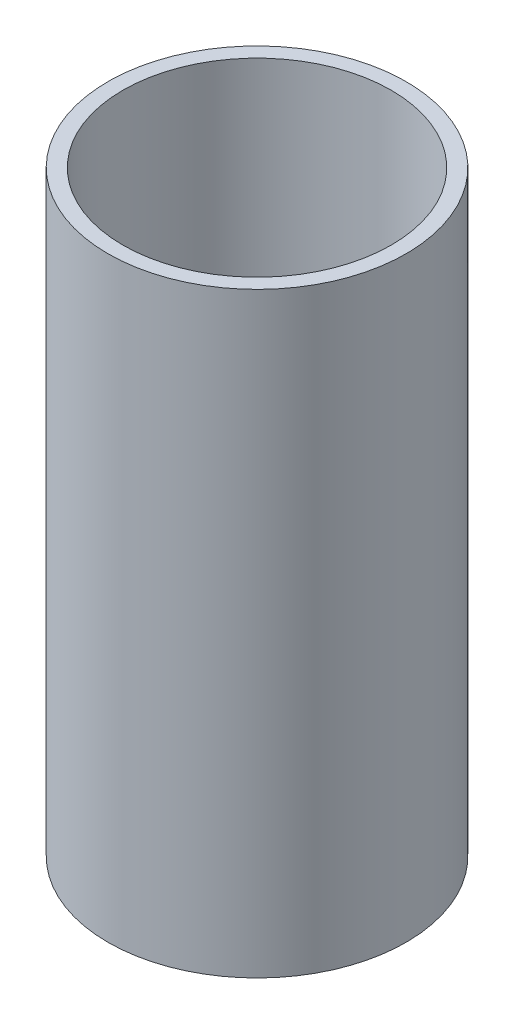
ISO-10303-21;
HEADER;
FILE_DESCRIPTION(('STEP AP214'),'2;1');
FILE_NAME('part.step','',(''),(''),'','','');
FILE_SCHEMA(('AUTOMOTIVE_DESIGN { 1 0 10303 214 1 1 1 1 }'));
ENDSEC;
DATA;
#1=APPLICATION_CONTEXT('core data for automotive mechanical design processes');
#2=APPLICATION_PROTOCOL_DEFINITION('international standard','automotive_design',2000,#1);
#3=PRODUCT_CONTEXT('',#1,'mechanical');
#4=PRODUCT('Part','Part','',(#3));
#5=PRODUCT_RELATED_PRODUCT_CATEGORY('part','',(#4));
#6=PRODUCT_DEFINITION_FORMATION('','',#4);
#7=PRODUCT_DEFINITION_CONTEXT('part definition',#1,'design');
#8=PRODUCT_DEFINITION('design','',#6,#7);
#9=PRODUCT_DEFINITION_SHAPE('','',#8);
#10=(LENGTH_UNIT() NAMED_UNIT(*) SI_UNIT(.MILLI.,.METRE.));
#11=(NAMED_UNIT(*) PLANE_ANGLE_UNIT() SI_UNIT($,.RADIAN.));
#12=(NAMED_UNIT(*) SI_UNIT($,.STERADIAN.) SOLID_ANGLE_UNIT());
#13=UNCERTAINTY_MEASURE_WITH_UNIT(LENGTH_MEASURE(1.E-05),#10,'distance_accuracy_value','');
#14=(GEOMETRIC_REPRESENTATION_CONTEXT(3) GLOBAL_UNCERTAINTY_ASSIGNED_CONTEXT((#13)) GLOBAL_UNIT_ASSIGNED_CONTEXT((#10,
#11,#12)) REPRESENTATION_CONTEXT('',''));
#15=CARTESIAN_POINT('',(0.,0.,0.));
#16=DIRECTION('',(0.,0.,1.));
#17=DIRECTION('',(1.,0.,0.));
#18=AXIS2_PLACEMENT_3D('',#15,#16,#17);
#19=CARTESIAN_POINT('',(0.,60.,0.));
#20=DIRECTION('',(0.,1.,0.));
#21=DIRECTION('',(0.,0.,1.));
#22=AXIS2_PLACEMENT_3D('',#19,#20,#21);
#23=PLANE('',#22);
#24=CARTESIAN_POINT('',(0.,60.,0.));
#25=DIRECTION('',(0.,1.,0.));
#26=DIRECTION('',(0.,0.,1.));
#27=AXIS2_PLACEMENT_3D('',#24,#25,#26);
#28=CIRCLE('',#27,15.);
#29=CARTESIAN_POINT('',(0.,60.,15.));
#30=VERTEX_POINT('',#29);
#31=EDGE_CURVE('E10',#30,#30,#28,.T.);
#32=ORIENTED_EDGE('',*,*,#31,.T.);
#33=EDGE_LOOP('',(#32));
#34=FACE_BOUND('',#33,.T.);
#35=CARTESIAN_POINT('',(0.,60.,0.));
#36=DIRECTION('',(0.,1.,0.));
#37=DIRECTION('',(0.,0.,1.));
#38=AXIS2_PLACEMENT_3D('',#35,#36,#37);
#39=CIRCLE('',#38,13.5);
#40=CARTESIAN_POINT('',(0.,60.,13.5));
#41=VERTEX_POINT('',#40);
#42=EDGE_CURVE('E39',#41,#41,#39,.T.);
#43=ORIENTED_EDGE('',*,*,#42,.F.);
#44=EDGE_LOOP('',(#43));
#45=FACE_BOUND('',#44,.T.);
#46=ADVANCED_FACE('F28',(#34,#45),#23,.T.);
#47=CARTESIAN_POINT('',(0.,0.,0.));
#48=DIRECTION('',(0.,1.,0.));
#49=DIRECTION('',(0.,0.,1.));
#50=AXIS2_PLACEMENT_3D('',#47,#48,#49);
#51=PLANE('',#50);
#52=CARTESIAN_POINT('',(0.,0.,0.));
#53=DIRECTION('',(0.,1.,0.));
#54=DIRECTION('',(0.,0.,1.));
#55=AXIS2_PLACEMENT_3D('',#52,#53,#54);
#56=CIRCLE('',#55,15.);
#57=CARTESIAN_POINT('',(0.,0.,15.));
#58=VERTEX_POINT('',#57);
#59=EDGE_CURVE('E32',#58,#58,#56,.T.);
#60=ORIENTED_EDGE('',*,*,#59,.F.);
#61=EDGE_LOOP('',(#60));
#62=FACE_BOUND('',#61,.T.);
#63=CARTESIAN_POINT('',(0.,0.,0.));
#64=DIRECTION('',(0.,1.,0.));
#65=DIRECTION('',(0.,0.,1.));
#66=AXIS2_PLACEMENT_3D('',#63,#64,#65);
#67=CIRCLE('',#66,13.5);
#68=CARTESIAN_POINT('',(0.,0.,13.5));
#69=VERTEX_POINT('',#68);
#70=EDGE_CURVE('E41',#69,#69,#67,.T.);
#71=ORIENTED_EDGE('',*,*,#70,.T.);
#72=EDGE_LOOP('',(#71));
#73=FACE_BOUND('',#72,.T.);
#74=ADVANCED_FACE('F51',(#62,#73),#51,.F.);
#75=CARTESIAN_POINT('',(0.,60.,0.));
#76=DIRECTION('',(0.,-1.,0.));
#77=DIRECTION('',(0.,0.,-1.));
#78=AXIS2_PLACEMENT_3D('',#75,#76,#77);
#79=CYLINDRICAL_SURFACE('',#78,15.);
#80=ORIENTED_EDGE('',*,*,#31,.F.);
#81=EDGE_LOOP('',(#80));
#82=FACE_BOUND('',#81,.T.);
#83=ORIENTED_EDGE('',*,*,#59,.T.);
#84=EDGE_LOOP('',(#83));
#85=FACE_BOUND('',#84,.T.);
#86=ADVANCED_FACE('F30',(#82,#85),#79,.T.);
#87=CARTESIAN_POINT('',(0.,60.,0.));
#88=DIRECTION('',(0.,-1.,0.));
#89=DIRECTION('',(0.,0.,-1.));
#90=AXIS2_PLACEMENT_3D('',#87,#88,#89);
#91=CYLINDRICAL_SURFACE('',#90,13.5);
#92=ORIENTED_EDGE('',*,*,#42,.T.);
#93=EDGE_LOOP('',(#92));
#94=FACE_BOUND('',#93,.T.);
#95=ORIENTED_EDGE('',*,*,#70,.F.);
#96=EDGE_LOOP('',(#95));
#97=FACE_BOUND('',#96,.T.);
#98=ADVANCED_FACE('F47',(#94,#97),#91,.F.);
#99=CLOSED_SHELL('',(#46,#74,#86,#98));
#100=MANIFOLD_SOLID_BREP('B2',#99);
#101=ADVANCED_BREP_SHAPE_REPRESENTATION('',(#18,#100),#14);
#102=SHAPE_DEFINITION_REPRESENTATION(#9,#101);
ENDSEC;
END-ISO-10303-21;
